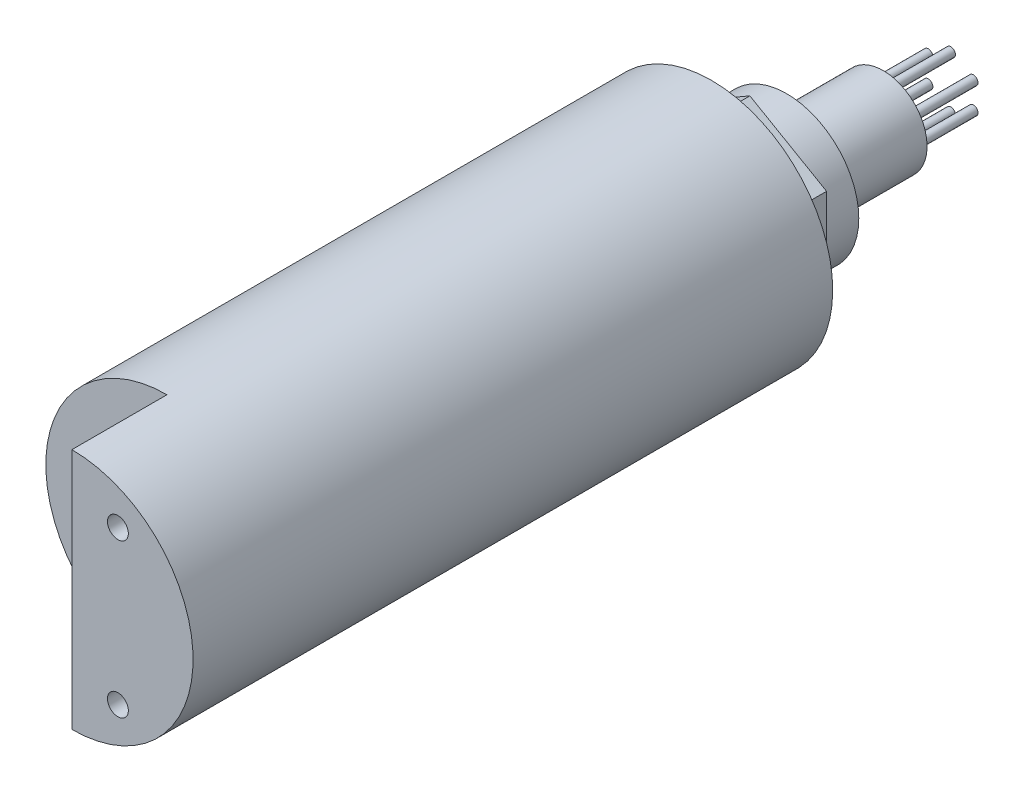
ISO-10303-21;
HEADER;
FILE_DESCRIPTION(('STEP AP214'),'2;1');
FILE_NAME('part.step','',(''),(''),'','','');
FILE_SCHEMA(('AUTOMOTIVE_DESIGN { 1 0 10303 214 1 1 1 1 }'));
ENDSEC;
DATA;
#1=APPLICATION_CONTEXT('core data for automotive mechanical design processes');
#2=APPLICATION_PROTOCOL_DEFINITION('international standard','automotive_design',2000,#1);
#3=PRODUCT_CONTEXT('',#1,'mechanical');
#4=PRODUCT('Part','Part','',(#3));
#5=PRODUCT_RELATED_PRODUCT_CATEGORY('part','',(#4));
#6=PRODUCT_DEFINITION_FORMATION('','',#4);
#7=PRODUCT_DEFINITION_CONTEXT('part definition',#1,'design');
#8=PRODUCT_DEFINITION('design','',#6,#7);
#9=PRODUCT_DEFINITION_SHAPE('','',#8);
#10=(LENGTH_UNIT() NAMED_UNIT(*) SI_UNIT(.MILLI.,.METRE.));
#11=(NAMED_UNIT(*) PLANE_ANGLE_UNIT() SI_UNIT($,.RADIAN.));
#12=(NAMED_UNIT(*) SI_UNIT($,.STERADIAN.) SOLID_ANGLE_UNIT());
#13=UNCERTAINTY_MEASURE_WITH_UNIT(LENGTH_MEASURE(1.E-05),#10,'distance_accuracy_value','');
#14=(GEOMETRIC_REPRESENTATION_CONTEXT(3) GLOBAL_UNCERTAINTY_ASSIGNED_CONTEXT((#13)) GLOBAL_UNIT_ASSIGNED_CONTEXT((#10,
#11,#12)) REPRESENTATION_CONTEXT('',''));
#15=CARTESIAN_POINT('',(0.,0.,0.));
#16=DIRECTION('',(0.,0.,1.));
#17=DIRECTION('',(1.,0.,0.));
#18=AXIS2_PLACEMENT_3D('',#15,#16,#17);
#19=CARTESIAN_POINT('',(0.,0.,-28.448));
#20=DIRECTION('',(0.,0.,-1.));
#21=DIRECTION('',(-1.,0.,0.));
#22=AXIS2_PLACEMENT_3D('',#19,#20,#21);
#23=PLANE('',#22);
#24=CARTESIAN_POINT('',(3.73949769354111,-2.15900000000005,-28.448));
#25=DIRECTION('',(0.,0.,-1.));
#26=DIRECTION('',(-1.,0.,0.));
#27=AXIS2_PLACEMENT_3D('',#24,#25,#26);
#28=CIRCLE('',#27,0.762000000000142);
#29=CARTESIAN_POINT('',(2.97749769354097,-2.15900000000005,-28.448));
#30=VERTEX_POINT('',#29);
#31=EDGE_CURVE('E445',#30,#30,#28,.T.);
#32=ORIENTED_EDGE('',*,*,#31,.F.);
#33=EDGE_LOOP('',(#32));
#34=FACE_BOUND('',#33,.T.);
#35=CARTESIAN_POINT('',(-3.7394976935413,-2.15899999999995,-28.448));
#36=DIRECTION('',(0.,0.,-1.));
#37=DIRECTION('',(-1.,0.,0.));
#38=AXIS2_PLACEMENT_3D('',#35,#36,#37);
#39=CIRCLE('',#38,0.762000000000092);
#40=CARTESIAN_POINT('',(-4.50149769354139,-2.15899999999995,-28.448));
#41=VERTEX_POINT('',#40);
#42=EDGE_CURVE('E462',#41,#41,#39,.T.);
#43=ORIENTED_EDGE('',*,*,#42,.F.);
#44=EDGE_LOOP('',(#43));
#45=FACE_BOUND('',#44,.T.);
#46=CARTESIAN_POINT('',(0.,4.318,-28.448));
#47=DIRECTION('',(0.,0.,-1.));
#48=DIRECTION('',(-1.,0.,0.));
#49=AXIS2_PLACEMENT_3D('',#46,#47,#48);
#50=CIRCLE('',#49,0.762);
#51=CARTESIAN_POINT('',(-0.762,4.318,-28.448));
#52=VERTEX_POINT('',#51);
#53=EDGE_CURVE('E474',#52,#52,#50,.T.);
#54=ORIENTED_EDGE('',*,*,#53,.F.);
#55=EDGE_LOOP('',(#54));
#56=FACE_BOUND('',#55,.T.);
#57=CARTESIAN_POINT('',(0.,0.,-28.448));
#58=DIRECTION('',(0.,0.,-1.));
#59=DIRECTION('',(-1.,0.,0.));
#60=AXIS2_PLACEMENT_3D('',#57,#58,#59);
#61=CIRCLE('',#60,7.239);
#62=CARTESIAN_POINT('',(-7.239,0.,-28.448));
#63=VERTEX_POINT('',#62);
#64=EDGE_CURVE('E483',#63,#63,#61,.T.);
#65=ORIENTED_EDGE('',*,*,#64,.T.);
#66=EDGE_LOOP('',(#65));
#67=FACE_BOUND('',#66,.T.);
#68=CARTESIAN_POINT('',(-3.73949769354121,2.15899999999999,-28.448));
#69=DIRECTION('',(0.,0.,-1.));
#70=DIRECTION('',(-1.,0.,0.));
#71=AXIS2_PLACEMENT_3D('',#68,#69,#70);
#72=CIRCLE('',#71,0.762);
#73=CARTESIAN_POINT('',(-4.50149769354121,2.15899999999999,-28.448));
#74=VERTEX_POINT('',#73);
#75=EDGE_CURVE('E468',#74,#74,#72,.T.);
#76=ORIENTED_EDGE('',*,*,#75,.F.);
#77=EDGE_LOOP('',(#76));
#78=FACE_BOUND('',#77,.T.);
#79=CARTESIAN_POINT('',(-1.22670886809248E-13,-4.318,-28.448));
#80=DIRECTION('',(0.,0.,-1.));
#81=DIRECTION('',(-1.,0.,0.));
#82=AXIS2_PLACEMENT_3D('',#79,#80,#81);
#83=CIRCLE('',#82,0.762000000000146);
#84=CARTESIAN_POINT('',(-0.762000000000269,-4.318,-28.448));
#85=VERTEX_POINT('',#84);
#86=EDGE_CURVE('E456',#85,#85,#83,.T.);
#87=ORIENTED_EDGE('',*,*,#86,.F.);
#88=EDGE_LOOP('',(#87));
#89=FACE_BOUND('',#88,.T.);
#90=CARTESIAN_POINT('',(3.73949769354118,2.15900000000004,-28.448));
#91=DIRECTION('',(0.,0.,-1.));
#92=DIRECTION('',(-1.,0.,0.));
#93=AXIS2_PLACEMENT_3D('',#90,#91,#92);
#94=CIRCLE('',#93,0.762);
#95=CARTESIAN_POINT('',(2.97749769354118,2.15900000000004,-28.448));
#96=VERTEX_POINT('',#95);
#97=EDGE_CURVE('E446',#96,#96,#94,.T.);
#98=ORIENTED_EDGE('',*,*,#97,.F.);
#99=EDGE_LOOP('',(#98));
#100=FACE_BOUND('',#99,.T.);
#101=ADVANCED_FACE('F31',(#34,#45,#56,#67,#78,#89,#100),#23,.T.);
#102=CARTESIAN_POINT('',(0.,0.,-12.446));
#103=DIRECTION('',(0.,0.,-1.));
#104=DIRECTION('',(-1.,0.,0.));
#105=AXIS2_PLACEMENT_3D('',#102,#103,#104);
#106=PLANE('',#105);
#107=CARTESIAN_POINT('',(0.,0.,-12.446));
#108=DIRECTION('',(0.,0.,-1.));
#109=DIRECTION('',(-1.,0.,0.));
#110=AXIS2_PLACEMENT_3D('',#107,#108,#109);
#111=CIRCLE('',#110,11.938);
#112=CARTESIAN_POINT('',(11.938,0.,-12.446));
#113=VERTEX_POINT('',#112);
#114=EDGE_CURVE('E100',#113,#113,#111,.T.);
#115=ORIENTED_EDGE('',*,*,#114,.T.);
#116=EDGE_LOOP('',(#115));
#117=FACE_BOUND('',#116,.T.);
#118=CARTESIAN_POINT('',(0.,0.,-12.446));
#119=DIRECTION('',(0.,0.,-1.));
#120=DIRECTION('',(-1.,0.,0.));
#121=AXIS2_PLACEMENT_3D('',#118,#119,#120);
#122=CIRCLE('',#121,7.239);
#123=CARTESIAN_POINT('',(-7.239,0.,-12.446));
#124=VERTEX_POINT('',#123);
#125=EDGE_CURVE('E480',#124,#124,#122,.T.);
#126=ORIENTED_EDGE('',*,*,#125,.F.);
#127=EDGE_LOOP('',(#126));
#128=FACE_BOUND('',#127,.T.);
#129=ADVANCED_FACE('F209',(#117,#128),#106,.T.);
#130=CARTESIAN_POINT('',(25.4000000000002,0.,-6.35));
#131=DIRECTION('',(0.,0.,1.));
#132=DIRECTION('',(1.,0.,0.));
#133=AXIS2_PLACEMENT_3D('',#130,#131,#132);
#134=PLANE('',#133);
#135=DIRECTION('',(-0.866025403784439,-0.5,0.));
#136=VECTOR('',#135,1.);
#137=CARTESIAN_POINT('',(12.7000000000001,-7.33234841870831,-6.35));
#138=LINE('',#137,#136);
#139=CARTESIAN_POINT('',(12.7000000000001,-7.33234841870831,-6.35));
#140=VERTEX_POINT('',#139);
#141=CARTESIAN_POINT('',(0.,-14.6646968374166,-6.35));
#142=VERTEX_POINT('',#141);
#143=EDGE_CURVE('E111',#140,#142,#138,.T.);
#144=ORIENTED_EDGE('',*,*,#143,.T.);
#145=DIRECTION('',(-0.866025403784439,0.5,0.));
#146=VECTOR('',#145,1.);
#147=CARTESIAN_POINT('',(0.,-14.6646968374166,-6.35));
#148=LINE('',#147,#146);
#149=CARTESIAN_POINT('',(-12.7000000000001,-7.33234841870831,-6.35));
#150=VERTEX_POINT('',#149);
#151=EDGE_CURVE('E495',#142,#150,#148,.T.);
#152=ORIENTED_EDGE('',*,*,#151,.T.);
#153=DIRECTION('',(0.,1.,0.));
#154=VECTOR('',#153,1.);
#155=CARTESIAN_POINT('',(-12.7000000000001,-7.33234841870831,-6.35));
#156=LINE('',#155,#154);
#157=CARTESIAN_POINT('',(-12.7000000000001,7.33234841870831,-6.35));
#158=VERTEX_POINT('',#157);
#159=EDGE_CURVE('E497',#150,#158,#156,.T.);
#160=ORIENTED_EDGE('',*,*,#159,.T.);
#161=DIRECTION('',(0.866025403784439,0.5,0.));
#162=VECTOR('',#161,1.);
#163=CARTESIAN_POINT('',(-12.7000000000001,7.33234841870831,-6.35));
#164=LINE('',#163,#162);
#165=CARTESIAN_POINT('',(0.,14.6646968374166,-6.35));
#166=VERTEX_POINT('',#165);
#167=EDGE_CURVE('E499',#158,#166,#164,.T.);
#168=ORIENTED_EDGE('',*,*,#167,.T.);
#169=DIRECTION('',(0.866025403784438,-0.5,0.));
#170=VECTOR('',#169,1.);
#171=CARTESIAN_POINT('',(0.,14.6646968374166,-6.35));
#172=LINE('',#171,#170);
#173=CARTESIAN_POINT('',(12.7000000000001,7.33234841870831,-6.35));
#174=VERTEX_POINT('',#173);
#175=EDGE_CURVE('E120',#166,#174,#172,.T.);
#176=ORIENTED_EDGE('',*,*,#175,.T.);
#177=DIRECTION('',(0.,-1.,0.));
#178=VECTOR('',#177,1.);
#179=CARTESIAN_POINT('',(12.7000000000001,7.33234841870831,-6.35));
#180=LINE('',#179,#178);
#181=EDGE_CURVE('E116',#174,#140,#180,.T.);
#182=ORIENTED_EDGE('',*,*,#181,.T.);
#183=EDGE_LOOP('',(#144,#152,#160,#168,#176,#182));
#184=FACE_BOUND('',#183,.T.);
#185=CARTESIAN_POINT('',(0.,0.,-6.35));
#186=DIRECTION('',(0.,0.,1.));
#187=DIRECTION('',(1.,0.,0.));
#188=AXIS2_PLACEMENT_3D('',#185,#186,#187);
#189=CIRCLE('',#188,11.938);
#190=CARTESIAN_POINT('',(11.938,0.,-6.35));
#191=VERTEX_POINT('',#190);
#192=EDGE_CURVE('E11',#191,#191,#189,.F.);
#193=ORIENTED_EDGE('',*,*,#192,.F.);
#194=EDGE_LOOP('',(#193));
#195=FACE_BOUND('',#194,.T.);
#196=ADVANCED_FACE('F215',(#184,#195),#134,.F.);
#197=CARTESIAN_POINT('',(0.,0.,0.));
#198=DIRECTION('',(0.,0.,1.));
#199=DIRECTION('',(1.,0.,0.));
#200=AXIS2_PLACEMENT_3D('',#197,#198,#199);
#201=PLANE('',#200);
#202=CARTESIAN_POINT('',(0.,0.,0.));
#203=DIRECTION('',(0.,0.,1.));
#204=DIRECTION('',(1.,0.,0.));
#205=AXIS2_PLACEMENT_3D('',#202,#203,#204);
#206=CIRCLE('',#205,20.066);
#207=CARTESIAN_POINT('',(20.066,0.,0.));
#208=VERTEX_POINT('',#207);
#209=EDGE_CURVE('E177',#208,#208,#206,.T.);
#210=ORIENTED_EDGE('',*,*,#209,.F.);
#211=EDGE_LOOP('',(#210));
#212=FACE_BOUND('',#211,.T.);
#213=DIRECTION('',(-0.866025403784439,-0.5,0.));
#214=VECTOR('',#213,1.);
#215=CARTESIAN_POINT('',(12.7000000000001,-7.33234841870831,0.));
#216=LINE('',#215,#214);
#217=CARTESIAN_POINT('',(12.7000000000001,-7.33234841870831,0.));
#218=VERTEX_POINT('',#217);
#219=CARTESIAN_POINT('',(0.,-14.6646968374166,0.));
#220=VERTEX_POINT('',#219);
#221=EDGE_CURVE('E92',#218,#220,#216,.T.);
#222=ORIENTED_EDGE('',*,*,#221,.F.);
#223=DIRECTION('',(0.,-1.,0.));
#224=VECTOR('',#223,1.);
#225=CARTESIAN_POINT('',(12.7000000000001,7.33234841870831,0.));
#226=LINE('',#225,#224);
#227=CARTESIAN_POINT('',(12.7000000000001,7.33234841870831,0.));
#228=VERTEX_POINT('',#227);
#229=EDGE_CURVE('E95',#228,#218,#226,.T.);
#230=ORIENTED_EDGE('',*,*,#229,.F.);
#231=DIRECTION('',(0.866025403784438,-0.5,0.));
#232=VECTOR('',#231,1.);
#233=CARTESIAN_POINT('',(0.,14.6646968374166,0.));
#234=LINE('',#233,#232);
#235=CARTESIAN_POINT('',(0.,14.6646968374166,0.));
#236=VERTEX_POINT('',#235);
#237=EDGE_CURVE('E112',#236,#228,#234,.T.);
#238=ORIENTED_EDGE('',*,*,#237,.F.);
#239=DIRECTION('',(0.866025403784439,0.5,0.));
#240=VECTOR('',#239,1.);
#241=CARTESIAN_POINT('',(-12.7000000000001,7.33234841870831,0.));
#242=LINE('',#241,#240);
#243=CARTESIAN_POINT('',(-12.7000000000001,7.33234841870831,0.));
#244=VERTEX_POINT('',#243);
#245=EDGE_CURVE('E490',#244,#236,#242,.T.);
#246=ORIENTED_EDGE('',*,*,#245,.F.);
#247=DIRECTION('',(0.,1.,0.));
#248=VECTOR('',#247,1.);
#249=CARTESIAN_POINT('',(-12.7000000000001,-7.33234841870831,0.));
#250=LINE('',#249,#248);
#251=CARTESIAN_POINT('',(-12.7000000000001,-7.33234841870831,0.));
#252=VERTEX_POINT('',#251);
#253=EDGE_CURVE('E51',#252,#244,#250,.T.);
#254=ORIENTED_EDGE('',*,*,#253,.F.);
#255=DIRECTION('',(-0.866025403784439,0.5,0.));
#256=VECTOR('',#255,1.);
#257=CARTESIAN_POINT('',(0.,-14.6646968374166,0.));
#258=LINE('',#257,#256);
#259=EDGE_CURVE('E46',#220,#252,#258,.T.);
#260=ORIENTED_EDGE('',*,*,#259,.F.);
#261=EDGE_LOOP('',(#222,#230,#238,#246,#254,#260));
#262=FACE_BOUND('',#261,.T.);
#263=ADVANCED_FACE('F94',(#212,#262),#201,.F.);
#264=CARTESIAN_POINT('',(0.,0.,90.17));
#265=DIRECTION('',(0.,0.,1.));
#266=DIRECTION('',(1.,0.,0.));
#267=AXIS2_PLACEMENT_3D('',#264,#265,#266);
#268=PLANE('',#267);
#269=DIRECTION('',(0.,-1.,0.));
#270=VECTOR('',#269,1.);
#271=CARTESIAN_POINT('',(0.,20.066,90.17));
#272=LINE('',#271,#270);
#273=CARTESIAN_POINT('',(0.,20.066,90.17));
#274=VERTEX_POINT('',#273);
#275=CARTESIAN_POINT('',(0.,-20.066,90.17));
#276=VERTEX_POINT('',#275);
#277=EDGE_CURVE('E158',#274,#276,#272,.T.);
#278=ORIENTED_EDGE('',*,*,#277,.F.);
#279=CARTESIAN_POINT('',(0.,0.,90.17));
#280=DIRECTION('',(0.,0.,1.));
#281=DIRECTION('',(1.,0.,0.));
#282=AXIS2_PLACEMENT_3D('',#279,#280,#281);
#283=CIRCLE('',#282,20.066);
#284=EDGE_CURVE('E39',#274,#276,#283,.T.);
#285=ORIENTED_EDGE('',*,*,#284,.T.);
#286=EDGE_LOOP('',(#278,#285));
#287=FACE_BOUND('',#286,.T.);
#288=CARTESIAN_POINT('',(-7.874,0.,90.17));
#289=DIRECTION('',(0.,0.,1.));
#290=DIRECTION('',(1.,0.,0.));
#291=AXIS2_PLACEMENT_3D('',#288,#289,#290);
#292=CIRCLE('',#291,6.35);
#293=CARTESIAN_POINT('',(-1.524,0.,90.17));
#294=VERTEX_POINT('',#293);
#295=EDGE_CURVE('E152',#294,#294,#292,.T.);
#296=ORIENTED_EDGE('',*,*,#295,.F.);
#297=EDGE_LOOP('',(#296));
#298=FACE_BOUND('',#297,.T.);
#299=ADVANCED_FACE('F193',(#287,#298),#268,.T.);
#300=CARTESIAN_POINT('',(0.,0.,90.17));
#301=DIRECTION('',(0.,0.,-1.));
#302=DIRECTION('',(-1.,0.,0.));
#303=AXIS2_PLACEMENT_3D('',#300,#301,#302);
#304=CYLINDRICAL_SURFACE('',#303,20.066);
#305=ORIENTED_EDGE('',*,*,#284,.F.);
#306=DIRECTION('',(0.,0.,-1.));
#307=VECTOR('',#306,1.);
#308=CARTESIAN_POINT('',(0.,20.066,105.918));
#309=LINE('',#308,#307);
#310=CARTESIAN_POINT('',(0.,20.066,105.918));
#311=VERTEX_POINT('',#310);
#312=EDGE_CURVE('E172',#311,#274,#309,.T.);
#313=ORIENTED_EDGE('',*,*,#312,.F.);
#314=CARTESIAN_POINT('',(0.,0.,105.918));
#315=DIRECTION('',(0.,0.,1.));
#316=DIRECTION('',(1.,0.,0.));
#317=AXIS2_PLACEMENT_3D('',#314,#315,#316);
#318=CIRCLE('',#317,20.066);
#319=CARTESIAN_POINT('',(0.,-20.066,105.918));
#320=VERTEX_POINT('',#319);
#321=EDGE_CURVE('E161',#320,#311,#318,.T.);
#322=ORIENTED_EDGE('',*,*,#321,.F.);
#323=DIRECTION('',(0.,0.,-1.));
#324=VECTOR('',#323,1.);
#325=CARTESIAN_POINT('',(0.,-20.066,105.918));
#326=LINE('',#325,#324);
#327=EDGE_CURVE('E169',#320,#276,#326,.T.);
#328=ORIENTED_EDGE('',*,*,#327,.T.);
#329=EDGE_LOOP('',(#305,#313,#322,#328));
#330=FACE_BOUND('',#329,.T.);
#331=ORIENTED_EDGE('',*,*,#209,.T.);
#332=EDGE_LOOP('',(#331));
#333=FACE_BOUND('',#332,.T.);
#334=ADVANCED_FACE('F33',(#330,#333),#304,.T.);
#335=CARTESIAN_POINT('',(0.,20.066,105.918));
#336=DIRECTION('',(1.,0.,0.));
#337=DIRECTION('',(0.,0.,-1.));
#338=AXIS2_PLACEMENT_3D('',#335,#336,#337);
#339=PLANE('',#338);
#340=CARTESIAN_POINT('',(0.,0.,96.266));
#341=DIRECTION('',(-1.,0.,0.));
#342=DIRECTION('',(0.,0.,1.));
#343=AXIS2_PLACEMENT_3D('',#340,#341,#342);
#344=CIRCLE('',#343,4.57199999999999);
#345=CARTESIAN_POINT('',(0.,0.,100.838));
#346=VERTEX_POINT('',#345);
#347=EDGE_CURVE('E146',#346,#346,#344,.T.);
#348=ORIENTED_EDGE('',*,*,#347,.F.);
#349=EDGE_LOOP('',(#348));
#350=FACE_BOUND('',#349,.T.);
#351=ORIENTED_EDGE('',*,*,#277,.T.);
#352=ORIENTED_EDGE('',*,*,#327,.F.);
#353=DIRECTION('',(0.,-1.,0.));
#354=VECTOR('',#353,1.);
#355=CARTESIAN_POINT('',(0.,20.066,105.918));
#356=LINE('',#355,#354);
#357=EDGE_CURVE('E173',#311,#320,#356,.T.);
#358=ORIENTED_EDGE('',*,*,#357,.F.);
#359=ORIENTED_EDGE('',*,*,#312,.T.);
#360=EDGE_LOOP('',(#351,#352,#358,#359));
#361=FACE_BOUND('',#360,.T.);
#362=ADVANCED_FACE('F195',(#350,#361),#339,.F.);
#363=CARTESIAN_POINT('',(0.,0.,105.918));
#364=DIRECTION('',(0.,0.,1.));
#365=DIRECTION('',(1.,0.,0.));
#366=AXIS2_PLACEMENT_3D('',#363,#364,#365);
#367=PLANE('',#366);
#368=CARTESIAN_POINT('',(7.62,-12.7,105.918));
#369=DIRECTION('',(0.,0.,1.));
#370=DIRECTION('',(-1.,0.,0.));
#371=AXIS2_PLACEMENT_3D('',#368,#369,#370);
#372=CIRCLE('',#371,1.7272);
#373=CARTESIAN_POINT('',(5.8928,-12.7,105.918));
#374=VERTEX_POINT('',#373);
#375=EDGE_CURVE('E134',#374,#374,#372,.T.);
#376=ORIENTED_EDGE('',*,*,#375,.F.);
#377=EDGE_LOOP('',(#376));
#378=FACE_BOUND('',#377,.T.);
#379=CARTESIAN_POINT('',(7.62,12.7,105.918));
#380=DIRECTION('',(0.,0.,1.));
#381=DIRECTION('',(1.,0.,0.));
#382=AXIS2_PLACEMENT_3D('',#379,#380,#381);
#383=CIRCLE('',#382,1.7272);
#384=CARTESIAN_POINT('',(9.3472,12.7,105.918));
#385=VERTEX_POINT('',#384);
#386=EDGE_CURVE('E140',#385,#385,#383,.T.);
#387=ORIENTED_EDGE('',*,*,#386,.F.);
#388=EDGE_LOOP('',(#387));
#389=FACE_BOUND('',#388,.T.);
#390=ORIENTED_EDGE('',*,*,#321,.T.);
#391=ORIENTED_EDGE('',*,*,#357,.T.);
#392=EDGE_LOOP('',(#390,#391));
#393=FACE_BOUND('',#392,.T.);
#394=ADVANCED_FACE('F189',(#378,#389,#393),#367,.T.);
#395=CARTESIAN_POINT('',(-7.874,0.,90.678));
#396=DIRECTION('',(0.,0.,-1.));
#397=DIRECTION('',(-1.,0.,0.));
#398=AXIS2_PLACEMENT_3D('',#395,#396,#397);
#399=CYLINDRICAL_SURFACE('',#398,6.35);
#400=CARTESIAN_POINT('',(-7.874,0.,90.678));
#401=DIRECTION('',(0.,0.,1.));
#402=DIRECTION('',(1.,0.,0.));
#403=AXIS2_PLACEMENT_3D('',#400,#401,#402);
#404=CIRCLE('',#403,6.35);
#405=CARTESIAN_POINT('',(-1.524,0.,90.678));
#406=VERTEX_POINT('',#405);
#407=EDGE_CURVE('E155',#406,#406,#404,.T.);
#408=ORIENTED_EDGE('',*,*,#407,.F.);
#409=EDGE_LOOP('',(#408));
#410=FACE_BOUND('',#409,.T.);
#411=ORIENTED_EDGE('',*,*,#295,.T.);
#412=EDGE_LOOP('',(#411));
#413=FACE_BOUND('',#412,.T.);
#414=ADVANCED_FACE('F203',(#410,#413),#399,.T.);
#415=CARTESIAN_POINT('',(-7.874,0.,90.678));
#416=DIRECTION('',(0.,0.,1.));
#417=DIRECTION('',(1.,0.,0.));
#418=AXIS2_PLACEMENT_3D('',#415,#416,#417);
#419=PLANE('',#418);
#420=ORIENTED_EDGE('',*,*,#407,.T.);
#421=EDGE_LOOP('',(#420));
#422=FACE_BOUND('',#421,.T.);
#423=ADVANCED_FACE('F278',(#422),#419,.T.);
#424=CARTESIAN_POINT('',(0.508,0.,96.266));
#425=DIRECTION('',(-1.,0.,0.));
#426=DIRECTION('',(0.,0.,1.));
#427=AXIS2_PLACEMENT_3D('',#424,#425,#426);
#428=CYLINDRICAL_SURFACE('',#427,4.57199999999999);
#429=CARTESIAN_POINT('',(0.508,0.,96.266));
#430=DIRECTION('',(-1.,0.,0.));
#431=DIRECTION('',(0.,0.,1.));
#432=AXIS2_PLACEMENT_3D('',#429,#430,#431);
#433=CIRCLE('',#432,4.57199999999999);
#434=CARTESIAN_POINT('',(0.508,0.,100.838));
#435=VERTEX_POINT('',#434);
#436=EDGE_CURVE('E149',#435,#435,#433,.T.);
#437=ORIENTED_EDGE('',*,*,#436,.F.);
#438=EDGE_LOOP('',(#437));
#439=FACE_BOUND('',#438,.T.);
#440=ORIENTED_EDGE('',*,*,#347,.T.);
#441=EDGE_LOOP('',(#440));
#442=FACE_BOUND('',#441,.T.);
#443=ADVANCED_FACE('F274',(#439,#442),#428,.F.);
#444=CARTESIAN_POINT('',(0.508,0.,96.266));
#445=DIRECTION('',(-1.,0.,0.));
#446=DIRECTION('',(0.,0.,1.));
#447=AXIS2_PLACEMENT_3D('',#444,#445,#446);
#448=PLANE('',#447);
#449=ORIENTED_EDGE('',*,*,#436,.T.);
#450=EDGE_LOOP('',(#449));
#451=FACE_BOUND('',#450,.T.);
#452=ADVANCED_FACE('F270',(#451),#448,.T.);
#453=CARTESIAN_POINT('',(7.62,12.7,99.568));
#454=DIRECTION('',(0.,0.,1.));
#455=DIRECTION('',(1.,0.,0.));
#456=AXIS2_PLACEMENT_3D('',#453,#454,#455);
#457=CYLINDRICAL_SURFACE('',#456,1.7272);
#458=CARTESIAN_POINT('',(7.62,12.7,99.568));
#459=DIRECTION('',(0.,0.,1.));
#460=DIRECTION('',(1.,0.,0.));
#461=AXIS2_PLACEMENT_3D('',#458,#459,#460);
#462=CIRCLE('',#461,1.7272);
#463=CARTESIAN_POINT('',(9.3472,12.7,99.568));
#464=VERTEX_POINT('',#463);
#465=EDGE_CURVE('E143',#464,#464,#462,.T.);
#466=ORIENTED_EDGE('',*,*,#465,.F.);
#467=EDGE_LOOP('',(#466));
#468=FACE_BOUND('',#467,.T.);
#469=ORIENTED_EDGE('',*,*,#386,.T.);
#470=EDGE_LOOP('',(#469));
#471=FACE_BOUND('',#470,.T.);
#472=ADVANCED_FACE('F266',(#468,#471),#457,.F.);
#473=CARTESIAN_POINT('',(7.62,12.7,99.568));
#474=DIRECTION('',(0.,0.,1.));
#475=DIRECTION('',(1.,0.,0.));
#476=AXIS2_PLACEMENT_3D('',#473,#474,#475);
#477=PLANE('',#476);
#478=ORIENTED_EDGE('',*,*,#465,.T.);
#479=EDGE_LOOP('',(#478));
#480=FACE_BOUND('',#479,.T.);
#481=ADVANCED_FACE('F262',(#480),#477,.T.);
#482=CARTESIAN_POINT('',(7.62,-12.7,99.568));
#483=DIRECTION('',(0.,0.,1.));
#484=DIRECTION('',(1.,0.,0.));
#485=AXIS2_PLACEMENT_3D('',#482,#483,#484);
#486=CYLINDRICAL_SURFACE('',#485,1.7272);
#487=CARTESIAN_POINT('',(7.62,-12.7,99.568));
#488=DIRECTION('',(0.,0.,1.));
#489=DIRECTION('',(-1.,0.,0.));
#490=AXIS2_PLACEMENT_3D('',#487,#488,#489);
#491=CIRCLE('',#490,1.7272);
#492=CARTESIAN_POINT('',(5.8928,-12.7,99.568));
#493=VERTEX_POINT('',#492);
#494=EDGE_CURVE('E137',#493,#493,#491,.T.);
#495=ORIENTED_EDGE('',*,*,#494,.F.);
#496=EDGE_LOOP('',(#495));
#497=FACE_BOUND('',#496,.T.);
#498=ORIENTED_EDGE('',*,*,#375,.T.);
#499=EDGE_LOOP('',(#498));
#500=FACE_BOUND('',#499,.T.);
#501=ADVANCED_FACE('F258',(#497,#500),#486,.F.);
#502=CARTESIAN_POINT('',(7.62,-12.7,99.568));
#503=DIRECTION('',(0.,0.,-1.));
#504=DIRECTION('',(-1.,0.,0.));
#505=AXIS2_PLACEMENT_3D('',#502,#503,#504);
#506=PLANE('',#505);
#507=ORIENTED_EDGE('',*,*,#494,.T.);
#508=EDGE_LOOP('',(#507));
#509=FACE_BOUND('',#508,.T.);
#510=ADVANCED_FACE('F255',(#509),#506,.F.);
#511=CARTESIAN_POINT('',(12.7000000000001,-7.33234841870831,-6.35));
#512=DIRECTION('',(-0.5,0.866025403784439,0.));
#513=DIRECTION('',(-0.866025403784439,-0.5,0.));
#514=AXIS2_PLACEMENT_3D('',#511,#512,#513);
#515=PLANE('',#514);
#516=ORIENTED_EDGE('',*,*,#221,.T.);
#517=DIRECTION('',(0.,0.,1.));
#518=VECTOR('',#517,1.);
#519=CARTESIAN_POINT('',(0.,-14.6646968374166,-6.35));
#520=LINE('',#519,#518);
#521=EDGE_CURVE('E132',#142,#220,#520,.T.);
#522=ORIENTED_EDGE('',*,*,#521,.F.);
#523=ORIENTED_EDGE('',*,*,#143,.F.);
#524=DIRECTION('',(0.,0.,1.));
#525=VECTOR('',#524,1.);
#526=CARTESIAN_POINT('',(12.7000000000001,-7.33234841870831,-6.35));
#527=LINE('',#526,#525);
#528=EDGE_CURVE('E107',#140,#218,#527,.T.);
#529=ORIENTED_EDGE('',*,*,#528,.T.);
#530=EDGE_LOOP('',(#516,#522,#523,#529));
#531=FACE_BOUND('',#530,.T.);
#532=ADVANCED_FACE('F114',(#531),#515,.F.);
#533=CARTESIAN_POINT('',(0.,-14.6646968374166,-6.35));
#534=DIRECTION('',(0.5,0.866025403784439,0.));
#535=DIRECTION('',(-0.866025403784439,0.5,0.));
#536=AXIS2_PLACEMENT_3D('',#533,#534,#535);
#537=PLANE('',#536);
#538=ORIENTED_EDGE('',*,*,#259,.T.);
#539=DIRECTION('',(0.,0.,1.));
#540=VECTOR('',#539,1.);
#541=CARTESIAN_POINT('',(-12.7000000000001,-7.33234841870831,-6.35));
#542=LINE('',#541,#540);
#543=EDGE_CURVE('E129',#150,#252,#542,.T.);
#544=ORIENTED_EDGE('',*,*,#543,.F.);
#545=ORIENTED_EDGE('',*,*,#151,.F.);
#546=ORIENTED_EDGE('',*,*,#521,.T.);
#547=EDGE_LOOP('',(#538,#544,#545,#546));
#548=FACE_BOUND('',#547,.T.);
#549=ADVANCED_FACE('F248',(#548),#537,.F.);
#550=CARTESIAN_POINT('',(-12.7000000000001,-7.33234841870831,-6.35));
#551=DIRECTION('',(1.,0.,0.));
#552=DIRECTION('',(0.,1.,0.));
#553=AXIS2_PLACEMENT_3D('',#550,#551,#552);
#554=PLANE('',#553);
#555=ORIENTED_EDGE('',*,*,#253,.T.);
#556=DIRECTION('',(0.,0.,1.));
#557=VECTOR('',#556,1.);
#558=CARTESIAN_POINT('',(-12.7000000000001,7.33234841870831,-6.35));
#559=LINE('',#558,#557);
#560=EDGE_CURVE('E126',#158,#244,#559,.T.);
#561=ORIENTED_EDGE('',*,*,#560,.F.);
#562=ORIENTED_EDGE('',*,*,#159,.F.);
#563=ORIENTED_EDGE('',*,*,#543,.T.);
#564=EDGE_LOOP('',(#555,#561,#562,#563));
#565=FACE_BOUND('',#564,.T.);
#566=ADVANCED_FACE('F244',(#565),#554,.F.);
#567=CARTESIAN_POINT('',(-12.7000000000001,7.33234841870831,-6.35));
#568=DIRECTION('',(0.5,-0.866025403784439,0.));
#569=DIRECTION('',(0.866025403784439,0.5,0.));
#570=AXIS2_PLACEMENT_3D('',#567,#568,#569);
#571=PLANE('',#570);
#572=ORIENTED_EDGE('',*,*,#245,.T.);
#573=DIRECTION('',(0.,0.,1.));
#574=VECTOR('',#573,1.);
#575=CARTESIAN_POINT('',(0.,14.6646968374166,-6.35));
#576=LINE('',#575,#574);
#577=EDGE_CURVE('E118',#166,#236,#576,.T.);
#578=ORIENTED_EDGE('',*,*,#577,.F.);
#579=ORIENTED_EDGE('',*,*,#167,.F.);
#580=ORIENTED_EDGE('',*,*,#560,.T.);
#581=EDGE_LOOP('',(#572,#578,#579,#580));
#582=FACE_BOUND('',#581,.T.);
#583=ADVANCED_FACE('F240',(#582),#571,.F.);
#584=CARTESIAN_POINT('',(0.,14.6646968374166,-6.35));
#585=DIRECTION('',(-0.5,-0.866025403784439,0.));
#586=DIRECTION('',(0.866025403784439,-0.5,0.));
#587=AXIS2_PLACEMENT_3D('',#584,#585,#586);
#588=PLANE('',#587);
#589=ORIENTED_EDGE('',*,*,#237,.T.);
#590=DIRECTION('',(0.,0.,1.));
#591=VECTOR('',#590,1.);
#592=CARTESIAN_POINT('',(12.7000000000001,7.33234841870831,-6.35));
#593=LINE('',#592,#591);
#594=EDGE_CURVE('E110',#174,#228,#593,.T.);
#595=ORIENTED_EDGE('',*,*,#594,.F.);
#596=ORIENTED_EDGE('',*,*,#175,.F.);
#597=ORIENTED_EDGE('',*,*,#577,.T.);
#598=EDGE_LOOP('',(#589,#595,#596,#597));
#599=FACE_BOUND('',#598,.T.);
#600=ADVANCED_FACE('F237',(#599),#588,.F.);
#601=CARTESIAN_POINT('',(12.7000000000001,7.33234841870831,-6.35));
#602=DIRECTION('',(-1.,0.,0.));
#603=DIRECTION('',(0.,0.,1.));
#604=AXIS2_PLACEMENT_3D('',#601,#602,#603);
#605=PLANE('',#604);
#606=ORIENTED_EDGE('',*,*,#229,.T.);
#607=ORIENTED_EDGE('',*,*,#528,.F.);
#608=ORIENTED_EDGE('',*,*,#181,.F.);
#609=ORIENTED_EDGE('',*,*,#594,.T.);
#610=EDGE_LOOP('',(#606,#607,#608,#609));
#611=FACE_BOUND('',#610,.T.);
#612=ADVANCED_FACE('F105',(#611),#605,.F.);
#613=CARTESIAN_POINT('',(0.,0.,-12.446));
#614=DIRECTION('',(0.,0.,1.));
#615=DIRECTION('',(1.,0.,0.));
#616=AXIS2_PLACEMENT_3D('',#613,#614,#615);
#617=CYLINDRICAL_SURFACE('',#616,11.938);
#618=CARTESIAN_POINT('',(11.938,0.,-12.446));
#619=CARTESIAN_POINT('',(11.938,0.,-12.3825));
#620=CARTESIAN_POINT('',(11.938,0.,-12.319));
#621=CARTESIAN_POINT('',(11.938,0.,-12.192));
#622=CARTESIAN_POINT('',(11.938,0.,-12.1285));
#623=CARTESIAN_POINT('',(11.938,0.,-12.0015));
#624=CARTESIAN_POINT('',(11.938,0.,-11.938));
#625=CARTESIAN_POINT('',(11.938,0.,-11.811));
#626=CARTESIAN_POINT('',(11.938,0.,-11.7475));
#627=CARTESIAN_POINT('',(11.938,0.,-11.6205));
#628=CARTESIAN_POINT('',(11.938,0.,-11.557));
#629=CARTESIAN_POINT('',(11.938,0.,-11.43));
#630=CARTESIAN_POINT('',(11.938,0.,-11.3665));
#631=CARTESIAN_POINT('',(11.938,0.,-11.2395));
#632=CARTESIAN_POINT('',(11.938,0.,-11.176));
#633=CARTESIAN_POINT('',(11.938,0.,-11.049));
#634=CARTESIAN_POINT('',(11.938,0.,-10.9855));
#635=CARTESIAN_POINT('',(11.938,0.,-10.8585));
#636=CARTESIAN_POINT('',(11.938,0.,-10.795));
#637=CARTESIAN_POINT('',(11.938,0.,-10.668));
#638=CARTESIAN_POINT('',(11.938,0.,-10.6045));
#639=CARTESIAN_POINT('',(11.938,0.,-10.4775));
#640=CARTESIAN_POINT('',(11.938,0.,-10.414));
#641=CARTESIAN_POINT('',(11.938,0.,-10.287));
#642=CARTESIAN_POINT('',(11.938,0.,-10.2235));
#643=CARTESIAN_POINT('',(11.938,0.,-10.0965));
#644=CARTESIAN_POINT('',(11.938,0.,-10.033));
#645=CARTESIAN_POINT('',(11.938,0.,-9.906));
#646=CARTESIAN_POINT('',(11.938,0.,-9.8425));
#647=CARTESIAN_POINT('',(11.938,0.,-9.7155));
#648=CARTESIAN_POINT('',(11.938,0.,-9.652));
#649=CARTESIAN_POINT('',(11.938,0.,-9.525));
#650=CARTESIAN_POINT('',(11.938,0.,-9.4615));
#651=CARTESIAN_POINT('',(11.938,0.,-9.3345));
#652=CARTESIAN_POINT('',(11.938,0.,-9.271));
#653=CARTESIAN_POINT('',(11.938,0.,-9.144));
#654=CARTESIAN_POINT('',(11.938,0.,-9.0805));
#655=CARTESIAN_POINT('',(11.938,0.,-8.9535));
#656=CARTESIAN_POINT('',(11.938,0.,-8.89));
#657=CARTESIAN_POINT('',(11.938,0.,-8.763));
#658=CARTESIAN_POINT('',(11.938,0.,-8.6995));
#659=CARTESIAN_POINT('',(11.938,0.,-8.5725));
#660=CARTESIAN_POINT('',(11.938,0.,-8.509));
#661=CARTESIAN_POINT('',(11.938,0.,-8.382));
#662=CARTESIAN_POINT('',(11.938,0.,-8.3185));
#663=CARTESIAN_POINT('',(11.938,0.,-8.1915));
#664=CARTESIAN_POINT('',(11.938,0.,-8.128));
#665=CARTESIAN_POINT('',(11.938,0.,-8.001));
#666=CARTESIAN_POINT('',(11.938,0.,-7.9375));
#667=CARTESIAN_POINT('',(11.938,0.,-7.8105));
#668=CARTESIAN_POINT('',(11.938,0.,-7.747));
#669=CARTESIAN_POINT('',(11.938,0.,-7.62));
#670=CARTESIAN_POINT('',(11.938,0.,-7.5565));
#671=CARTESIAN_POINT('',(11.938,0.,-7.4295));
#672=CARTESIAN_POINT('',(11.938,0.,-7.366));
#673=CARTESIAN_POINT('',(11.938,0.,-7.239));
#674=CARTESIAN_POINT('',(11.938,0.,-7.1755));
#675=CARTESIAN_POINT('',(11.938,0.,-7.0485));
#676=CARTESIAN_POINT('',(11.938,0.,-6.985));
#677=CARTESIAN_POINT('',(11.938,0.,-6.858));
#678=CARTESIAN_POINT('',(11.938,0.,-6.7945));
#679=CARTESIAN_POINT('',(11.938,0.,-6.6675));
#680=CARTESIAN_POINT('',(11.938,0.,-6.604));
#681=CARTESIAN_POINT('',(11.938,0.,-6.477));
#682=CARTESIAN_POINT('',(11.938,0.,-6.4135));
#683=CARTESIAN_POINT('',(11.938,0.,-6.35));
#684=B_SPLINE_CURVE_WITH_KNOTS('',3,(#618,#619,#620,#621,#622,#623,#624,#625,#626,#627,#628,
#629,#630,#631,#632,#633,#634,#635,#636,#637,#638,#639,#640,#641,#642,#643,#644,#645,#646,#647,
#648,#649,#650,#651,#652,#653,#654,#655,#656,#657,#658,#659,#660,#661,#662,#663,#664,#665,#666,
#667,#668,#669,#670,#671,#672,#673,#674,#675,#676,#677,#678,#679,#680,#681,#682,#683),
.UNSPECIFIED.,.F.,.F.,(4,2,2,2,2,2,2,2,2,2,2,2,2,2,2,2,2,2,2,2,2,2,2,2,2,2,2,2,2,2,2,2,4),(0.,
0.1905,0.380999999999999,0.571499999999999,0.761999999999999,0.952499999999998,1.143,1.3335,
1.524,1.7145,1.905,2.0955,2.286,2.4765,2.667,2.8575,3.048,3.2385,3.429,3.6195,3.81,4.0005,4.191,
4.3815,4.572,4.7625,4.953,5.1435,5.334,5.5245,5.715,5.9055,6.096),.UNSPECIFIED.);
#685=EDGE_CURVE('BSEAM226',#113,#191,#684,.T.);
#686=ORIENTED_EDGE('',*,*,#114,.F.);
#687=ORIENTED_EDGE('',*,*,#192,.T.);
#688=ORIENTED_EDGE('',*,*,#685,.T.);
#689=ORIENTED_EDGE('',*,*,#685,.F.);
#690=EDGE_LOOP('',(#686,#688,#687,#689));
#691=FACE_BOUND('',#690,.T.);
#692=ADVANCED_FACE('F226',(#691),#617,.T.);
#693=CARTESIAN_POINT('',(0.,0.,-28.448));
#694=DIRECTION('',(0.,0.,1.));
#695=DIRECTION('',(1.,0.,0.));
#696=AXIS2_PLACEMENT_3D('',#693,#694,#695);
#697=CYLINDRICAL_SURFACE('',#696,7.239);
#698=ORIENTED_EDGE('',*,*,#64,.F.);
#699=EDGE_LOOP('',(#698));
#700=FACE_BOUND('',#699,.T.);
#701=ORIENTED_EDGE('',*,*,#125,.T.);
#702=EDGE_LOOP('',(#701));
#703=FACE_BOUND('',#702,.T.);
#704=ADVANCED_FACE('F224',(#700,#703),#697,.T.);
#705=CARTESIAN_POINT('',(0.,4.318,-39.624));
#706=DIRECTION('',(0.,0.,1.));
#707=DIRECTION('',(1.,0.,0.));
#708=AXIS2_PLACEMENT_3D('',#705,#706,#707);
#709=CYLINDRICAL_SURFACE('',#708,0.762);
#710=CARTESIAN_POINT('',(0.,4.318,-39.624));
#711=DIRECTION('',(0.,0.,-1.));
#712=DIRECTION('',(-1.,0.,0.));
#713=AXIS2_PLACEMENT_3D('',#710,#711,#712);
#714=CIRCLE('',#713,0.762);
#715=CARTESIAN_POINT('',(-0.762,4.318,-39.624));
#716=VERTEX_POINT('',#715);
#717=EDGE_CURVE('E477',#716,#716,#714,.T.);
#718=ORIENTED_EDGE('',*,*,#717,.F.);
#719=EDGE_LOOP('',(#718));
#720=FACE_BOUND('',#719,.T.);
#721=ORIENTED_EDGE('',*,*,#53,.T.);
#722=EDGE_LOOP('',(#721));
#723=FACE_BOUND('',#722,.T.);
#724=ADVANCED_FACE('F222',(#720,#723),#709,.T.);
#725=CARTESIAN_POINT('',(0.,4.318,-39.624));
#726=DIRECTION('',(0.,0.,-1.));
#727=DIRECTION('',(-1.,0.,0.));
#728=AXIS2_PLACEMENT_3D('',#725,#726,#727);
#729=PLANE('',#728);
#730=ORIENTED_EDGE('',*,*,#717,.T.);
#731=EDGE_LOOP('',(#730));
#732=FACE_BOUND('',#731,.T.);
#733=ADVANCED_FACE('F330',(#732),#729,.T.);
#734=CARTESIAN_POINT('',(-3.73949769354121,2.15899999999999,-39.624));
#735=DIRECTION('',(0.,0.,1.));
#736=DIRECTION('',(1.,0.,0.));
#737=AXIS2_PLACEMENT_3D('',#734,#735,#736);
#738=CYLINDRICAL_SURFACE('',#737,0.762);
#739=CARTESIAN_POINT('',(-3.73949769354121,2.15899999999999,-39.624));
#740=DIRECTION('',(0.,0.,-1.));
#741=DIRECTION('',(-1.,0.,0.));
#742=AXIS2_PLACEMENT_3D('',#739,#740,#741);
#743=CIRCLE('',#742,0.762);
#744=CARTESIAN_POINT('',(-4.50149769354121,2.15899999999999,-39.624));
#745=VERTEX_POINT('',#744);
#746=EDGE_CURVE('E471',#745,#745,#743,.T.);
#747=ORIENTED_EDGE('',*,*,#746,.F.);
#748=EDGE_LOOP('',(#747));
#749=FACE_BOUND('',#748,.T.);
#750=ORIENTED_EDGE('',*,*,#75,.T.);
#751=EDGE_LOOP('',(#750));
#752=FACE_BOUND('',#751,.T.);
#753=ADVANCED_FACE('F339',(#749,#752),#738,.T.);
#754=CARTESIAN_POINT('',(-3.73949769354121,2.15899999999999,-39.624));
#755=DIRECTION('',(0.,0.,-1.));
#756=DIRECTION('',(-1.,0.,0.));
#757=AXIS2_PLACEMENT_3D('',#754,#755,#756);
#758=PLANE('',#757);
#759=ORIENTED_EDGE('',*,*,#746,.T.);
#760=EDGE_LOOP('',(#759));
#761=FACE_BOUND('',#760,.T.);
#762=ADVANCED_FACE('F348',(#761),#758,.T.);
#763=CARTESIAN_POINT('',(-3.7394976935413,-2.15899999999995,-39.624));
#764=DIRECTION('',(0.,0.,1.));
#765=DIRECTION('',(1.,0.,0.));
#766=AXIS2_PLACEMENT_3D('',#763,#764,#765);
#767=CYLINDRICAL_SURFACE('',#766,0.762000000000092);
#768=CARTESIAN_POINT('',(-3.7394976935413,-2.15899999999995,-39.624));
#769=DIRECTION('',(0.,0.,-1.));
#770=DIRECTION('',(-1.,0.,0.));
#771=AXIS2_PLACEMENT_3D('',#768,#769,#770);
#772=CIRCLE('',#771,0.762000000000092);
#773=CARTESIAN_POINT('',(-4.50149769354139,-2.15899999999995,-39.624));
#774=VERTEX_POINT('',#773);
#775=EDGE_CURVE('E465',#774,#774,#772,.T.);
#776=ORIENTED_EDGE('',*,*,#775,.F.);
#777=EDGE_LOOP('',(#776));
#778=FACE_BOUND('',#777,.T.);
#779=ORIENTED_EDGE('',*,*,#42,.T.);
#780=EDGE_LOOP('',(#779));
#781=FACE_BOUND('',#780,.T.);
#782=ADVANCED_FACE('F358',(#778,#781),#767,.T.);
#783=CARTESIAN_POINT('',(-3.7394976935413,-2.15899999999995,-39.624));
#784=DIRECTION('',(0.,0.,-1.));
#785=DIRECTION('',(-1.,0.,0.));
#786=AXIS2_PLACEMENT_3D('',#783,#784,#785);
#787=PLANE('',#786);
#788=ORIENTED_EDGE('',*,*,#775,.T.);
#789=EDGE_LOOP('',(#788));
#790=FACE_BOUND('',#789,.T.);
#791=ADVANCED_FACE('F368',(#790),#787,.T.);
#792=CARTESIAN_POINT('',(-1.22670886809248E-13,-4.318,-39.624));
#793=DIRECTION('',(0.,0.,1.));
#794=DIRECTION('',(1.,0.,0.));
#795=AXIS2_PLACEMENT_3D('',#792,#793,#794);
#796=CYLINDRICAL_SURFACE('',#795,0.762000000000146);
#797=CARTESIAN_POINT('',(-1.22670886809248E-13,-4.318,-39.624));
#798=DIRECTION('',(0.,0.,-1.));
#799=DIRECTION('',(-1.,0.,0.));
#800=AXIS2_PLACEMENT_3D('',#797,#798,#799);
#801=CIRCLE('',#800,0.762000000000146);
#802=CARTESIAN_POINT('',(-0.762000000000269,-4.318,-39.624));
#803=VERTEX_POINT('',#802);
#804=EDGE_CURVE('E459',#803,#803,#801,.T.);
#805=ORIENTED_EDGE('',*,*,#804,.F.);
#806=EDGE_LOOP('',(#805));
#807=FACE_BOUND('',#806,.T.);
#808=ORIENTED_EDGE('',*,*,#86,.T.);
#809=EDGE_LOOP('',(#808));
#810=FACE_BOUND('',#809,.T.);
#811=ADVANCED_FACE('F378',(#807,#810),#796,.T.);
#812=CARTESIAN_POINT('',(-1.22670886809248E-13,-4.318,-39.624));
#813=DIRECTION('',(0.,0.,-1.));
#814=DIRECTION('',(-1.,0.,0.));
#815=AXIS2_PLACEMENT_3D('',#812,#813,#814);
#816=PLANE('',#815);
#817=ORIENTED_EDGE('',*,*,#804,.T.);
#818=EDGE_LOOP('',(#817));
#819=FACE_BOUND('',#818,.T.);
#820=ADVANCED_FACE('F388',(#819),#816,.T.);
#821=CARTESIAN_POINT('',(3.73949769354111,-2.15900000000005,-39.624));
#822=DIRECTION('',(0.,0.,1.));
#823=DIRECTION('',(1.,0.,0.));
#824=AXIS2_PLACEMENT_3D('',#821,#822,#823);
#825=CYLINDRICAL_SURFACE('',#824,0.762000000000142);
#826=CARTESIAN_POINT('',(3.73949769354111,-2.15900000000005,-39.624));
#827=DIRECTION('',(0.,0.,-1.));
#828=DIRECTION('',(-1.,0.,0.));
#829=AXIS2_PLACEMENT_3D('',#826,#827,#828);
#830=CIRCLE('',#829,0.762000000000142);
#831=CARTESIAN_POINT('',(2.97749769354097,-2.15900000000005,-39.624));
#832=VERTEX_POINT('',#831);
#833=EDGE_CURVE('E449',#832,#832,#830,.T.);
#834=ORIENTED_EDGE('',*,*,#833,.F.);
#835=EDGE_LOOP('',(#834));
#836=FACE_BOUND('',#835,.T.);
#837=ORIENTED_EDGE('',*,*,#31,.T.);
#838=EDGE_LOOP('',(#837));
#839=FACE_BOUND('',#838,.T.);
#840=ADVANCED_FACE('F398',(#836,#839),#825,.T.);
#841=CARTESIAN_POINT('',(3.73949769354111,-2.15900000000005,-39.624));
#842=DIRECTION('',(0.,0.,-1.));
#843=DIRECTION('',(-1.,0.,0.));
#844=AXIS2_PLACEMENT_3D('',#841,#842,#843);
#845=PLANE('',#844);
#846=ORIENTED_EDGE('',*,*,#833,.T.);
#847=EDGE_LOOP('',(#846));
#848=FACE_BOUND('',#847,.T.);
#849=ADVANCED_FACE('F408',(#848),#845,.T.);
#850=CARTESIAN_POINT('',(3.73949769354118,2.15900000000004,-39.624));
#851=DIRECTION('',(0.,0.,1.));
#852=DIRECTION('',(1.,0.,0.));
#853=AXIS2_PLACEMENT_3D('',#850,#851,#852);
#854=CYLINDRICAL_SURFACE('',#853,0.762);
#855=CARTESIAN_POINT('',(3.73949769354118,2.15900000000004,-39.624));
#856=DIRECTION('',(0.,0.,-1.));
#857=DIRECTION('',(-1.,0.,0.));
#858=AXIS2_PLACEMENT_3D('',#855,#856,#857);
#859=CIRCLE('',#858,0.762);
#860=CARTESIAN_POINT('',(2.97749769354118,2.15900000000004,-39.624));
#861=VERTEX_POINT('',#860);
#862=EDGE_CURVE('E444',#861,#861,#859,.T.);
#863=ORIENTED_EDGE('',*,*,#862,.F.);
#864=EDGE_LOOP('',(#863));
#865=FACE_BOUND('',#864,.T.);
#866=ORIENTED_EDGE('',*,*,#97,.T.);
#867=EDGE_LOOP('',(#866));
#868=FACE_BOUND('',#867,.T.);
#869=ADVANCED_FACE('F418',(#865,#868),#854,.T.);
#870=CARTESIAN_POINT('',(3.73949769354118,2.15900000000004,-39.624));
#871=DIRECTION('',(0.,0.,-1.));
#872=DIRECTION('',(-1.,0.,0.));
#873=AXIS2_PLACEMENT_3D('',#870,#871,#872);
#874=PLANE('',#873);
#875=ORIENTED_EDGE('',*,*,#862,.T.);
#876=EDGE_LOOP('',(#875));
#877=FACE_BOUND('',#876,.T.);
#878=ADVANCED_FACE('F428',(#877),#874,.T.);
#879=CLOSED_SHELL('',(#101,#129,#196,#263,#299,#334,#362,#394,#414,#423,#443,#452,#472,#481,
#501,#510,#532,#549,#566,#583,#600,#612,#692,#704,#724,#733,#753,#762,#782,#791,#811,#820,#840,
#849,#869,#878));
#880=MANIFOLD_SOLID_BREP('B2',#879);
#881=ADVANCED_BREP_SHAPE_REPRESENTATION('',(#18,#880),#14);
#882=SHAPE_DEFINITION_REPRESENTATION(#9,#881);
ENDSEC;
END-ISO-10303-21;
